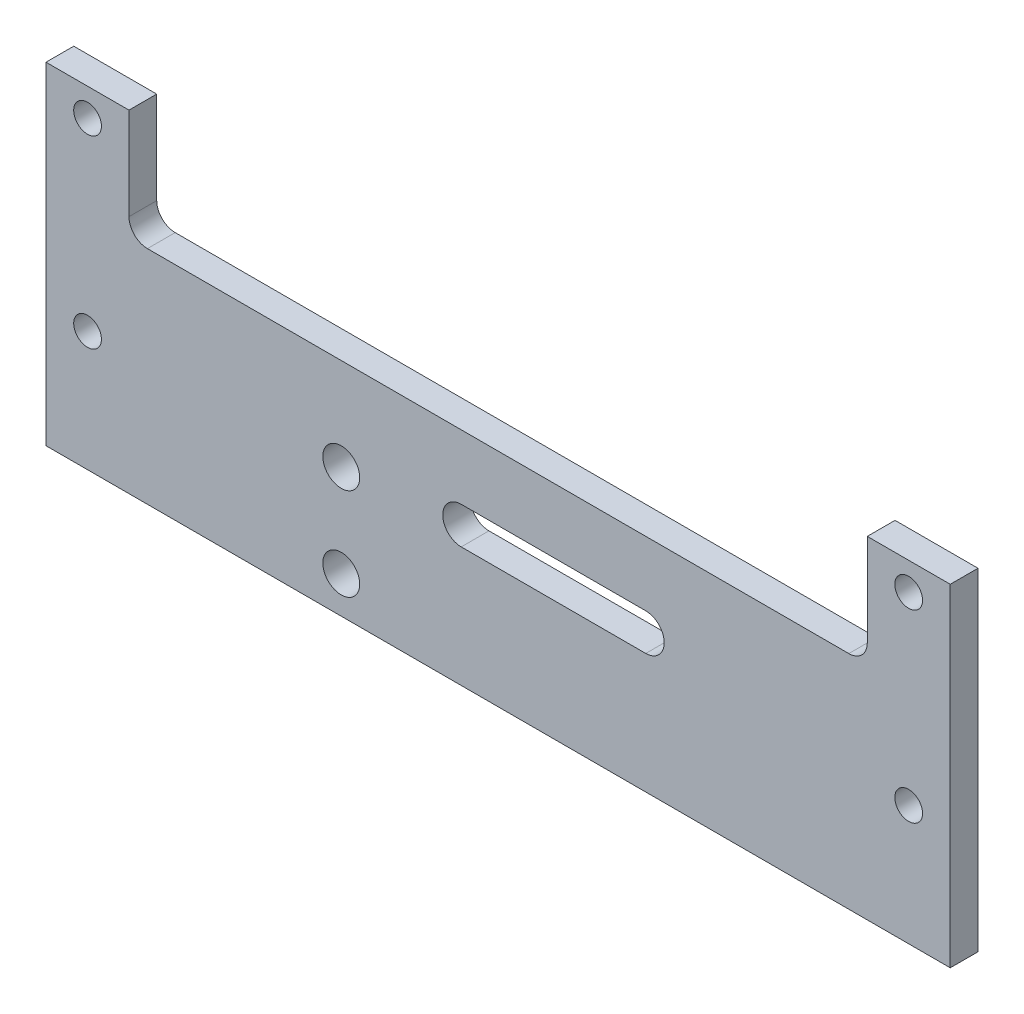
ISO-10303-21;
HEADER;
FILE_DESCRIPTION(('STEP AP214'),'2;1');
FILE_NAME('part.step','',(''),(''),'','','');
FILE_SCHEMA(('AUTOMOTIVE_DESIGN { 1 0 10303 214 1 1 1 1 }'));
ENDSEC;
DATA;
#1=APPLICATION_CONTEXT('core data for automotive mechanical design processes');
#2=APPLICATION_PROTOCOL_DEFINITION('international standard','automotive_design',2000,#1);
#3=PRODUCT_CONTEXT('',#1,'mechanical');
#4=PRODUCT('Part','Part','',(#3));
#5=PRODUCT_RELATED_PRODUCT_CATEGORY('part','',(#4));
#6=PRODUCT_DEFINITION_FORMATION('','',#4);
#7=PRODUCT_DEFINITION_CONTEXT('part definition',#1,'design');
#8=PRODUCT_DEFINITION('design','',#6,#7);
#9=PRODUCT_DEFINITION_SHAPE('','',#8);
#10=(LENGTH_UNIT() NAMED_UNIT(*) SI_UNIT(.MILLI.,.METRE.));
#11=(NAMED_UNIT(*) PLANE_ANGLE_UNIT() SI_UNIT($,.RADIAN.));
#12=(NAMED_UNIT(*) SI_UNIT($,.STERADIAN.) SOLID_ANGLE_UNIT());
#13=UNCERTAINTY_MEASURE_WITH_UNIT(LENGTH_MEASURE(1.E-05),#10,'distance_accuracy_value','');
#14=(GEOMETRIC_REPRESENTATION_CONTEXT(3) GLOBAL_UNCERTAINTY_ASSIGNED_CONTEXT((#13)) GLOBAL_UNIT_ASSIGNED_CONTEXT((#10,
#11,#12)) REPRESENTATION_CONTEXT('',''));
#15=CARTESIAN_POINT('',(0.,0.,0.));
#16=DIRECTION('',(0.,0.,1.));
#17=DIRECTION('',(1.,0.,0.));
#18=AXIS2_PLACEMENT_3D('',#15,#16,#17);
#19=CARTESIAN_POINT('',(0.,0.,4.7752));
#20=DIRECTION('',(0.,0.,1.));
#21=DIRECTION('',(1.,0.,0.));
#22=AXIS2_PLACEMENT_3D('',#19,#20,#21);
#23=PLANE('',#22);
#24=CARTESIAN_POINT('',(-26.9875,6.35,4.7752));
#25=DIRECTION('',(0.,0.,1.));
#26=DIRECTION('',(1.,0.,0.));
#27=AXIS2_PLACEMENT_3D('',#24,#25,#26);
#28=CIRCLE('',#27,3.175);
#29=CARTESIAN_POINT('',(-23.8125,6.35,4.7752));
#30=VERTEX_POINT('',#29);
#31=EDGE_CURVE('E167',#30,#30,#28,.T.);
#32=ORIENTED_EDGE('',*,*,#31,.F.);
#33=EDGE_LOOP('',(#32));
#34=FACE_BOUND('',#33,.T.);
#35=CARTESIAN_POINT('',(70.6374,52.3748,4.7752));
#36=DIRECTION('',(0.,0.,1.));
#37=DIRECTION('',(1.,0.,0.));
#38=AXIS2_PLACEMENT_3D('',#35,#36,#37);
#39=CIRCLE('',#38,2.38760000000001);
#40=CARTESIAN_POINT('',(73.025,52.3748,4.7752));
#41=VERTEX_POINT('',#40);
#42=EDGE_CURVE('E178',#41,#41,#39,.T.);
#43=ORIENTED_EDGE('',*,*,#42,.F.);
#44=EDGE_LOOP('',(#43));
#45=FACE_BOUND('',#44,.T.);
#46=CARTESIAN_POINT('',(-70.6374,52.3748,4.7752));
#47=DIRECTION('',(0.,0.,1.));
#48=DIRECTION('',(1.,0.,0.));
#49=AXIS2_PLACEMENT_3D('',#46,#47,#48);
#50=CIRCLE('',#49,2.38760000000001);
#51=CARTESIAN_POINT('',(-68.2498,52.3748,4.7752));
#52=VERTEX_POINT('',#51);
#53=EDGE_CURVE('E190',#52,#52,#50,.T.);
#54=ORIENTED_EDGE('',*,*,#53,.F.);
#55=EDGE_LOOP('',(#54));
#56=FACE_BOUND('',#55,.T.);
#57=DIRECTION('',(0.,-1.,0.));
#58=VECTOR('',#57,1.);
#59=CARTESIAN_POINT('',(-77.7875,57.15,4.7752));
#60=LINE('',#59,#58);
#61=CARTESIAN_POINT('',(-77.7875,57.15,4.7752));
#62=VERTEX_POINT('',#61);
#63=CARTESIAN_POINT('',(-77.7875,0.,4.7752));
#64=VERTEX_POINT('',#63);
#65=EDGE_CURVE('E202',#62,#64,#60,.T.);
#66=ORIENTED_EDGE('',*,*,#65,.T.);
#67=DIRECTION('',(1.,0.,0.));
#68=VECTOR('',#67,1.);
#69=CARTESIAN_POINT('',(-77.7875,0.,4.7752));
#70=LINE('',#69,#68);
#71=CARTESIAN_POINT('',(77.7875,0.,4.7752));
#72=VERTEX_POINT('',#71);
#73=EDGE_CURVE('E205',#64,#72,#70,.T.);
#74=ORIENTED_EDGE('',*,*,#73,.T.);
#75=DIRECTION('',(0.,1.,0.));
#76=VECTOR('',#75,1.);
#77=CARTESIAN_POINT('',(77.7875,0.,4.7752));
#78=LINE('',#77,#76);
#79=CARTESIAN_POINT('',(77.7875,57.15,4.7752));
#80=VERTEX_POINT('',#79);
#81=EDGE_CURVE('E208',#72,#80,#78,.T.);
#82=ORIENTED_EDGE('',*,*,#81,.T.);
#83=DIRECTION('',(-1.,0.,0.));
#84=VECTOR('',#83,1.);
#85=CARTESIAN_POINT('',(77.7875,57.15,4.7752));
#86=LINE('',#85,#84);
#87=CARTESIAN_POINT('',(63.5127,57.15,4.7752));
#88=VERTEX_POINT('',#87);
#89=EDGE_CURVE('E210',#80,#88,#86,.T.);
#90=ORIENTED_EDGE('',*,*,#89,.T.);
#91=DIRECTION('',(0.,-1.,0.));
#92=VECTOR('',#91,1.);
#93=CARTESIAN_POINT('',(63.5127,57.15,4.7752));
#94=LINE('',#93,#92);
#95=CARTESIAN_POINT('',(63.5127,41.275,4.7752));
#96=VERTEX_POINT('',#95);
#97=EDGE_CURVE('E212',#88,#96,#94,.T.);
#98=ORIENTED_EDGE('',*,*,#97,.T.);
#99=CARTESIAN_POINT('',(60.3377,41.275,4.7752));
#100=DIRECTION('',(0.,0.,1.));
#101=DIRECTION('',(1.,0.,0.));
#102=AXIS2_PLACEMENT_3D('',#99,#100,#101);
#103=CIRCLE('',#102,3.175);
#104=CARTESIAN_POINT('',(60.3377,38.1,4.7752));
#105=VERTEX_POINT('',#104);
#106=EDGE_CURVE('E267',#96,#105,#103,.F.);
#107=ORIENTED_EDGE('',*,*,#106,.T.);
#108=DIRECTION('',(-1.,0.,0.));
#109=VECTOR('',#108,1.);
#110=CARTESIAN_POINT('',(63.5127,38.1,4.7752));
#111=LINE('',#110,#109);
#112=CARTESIAN_POINT('',(-60.3377,38.1,4.7752));
#113=VERTEX_POINT('',#112);
#114=EDGE_CURVE('E215',#105,#113,#111,.T.);
#115=ORIENTED_EDGE('',*,*,#114,.T.);
#116=CARTESIAN_POINT('',(-60.3377,41.275,4.7752));
#117=DIRECTION('',(0.,0.,1.));
#118=DIRECTION('',(1.,0.,0.));
#119=AXIS2_PLACEMENT_3D('',#116,#117,#118);
#120=CIRCLE('',#119,3.175);
#121=CARTESIAN_POINT('',(-63.5127,41.275,4.7752));
#122=VERTEX_POINT('',#121);
#123=EDGE_CURVE('E11',#113,#122,#120,.F.);
#124=ORIENTED_EDGE('',*,*,#123,.T.);
#125=DIRECTION('',(0.,1.,0.));
#126=VECTOR('',#125,1.);
#127=CARTESIAN_POINT('',(-63.5127,38.1,4.7752));
#128=LINE('',#127,#126);
#129=CARTESIAN_POINT('',(-63.5127,57.15,4.7752));
#130=VERTEX_POINT('',#129);
#131=EDGE_CURVE('E217',#122,#130,#128,.T.);
#132=ORIENTED_EDGE('',*,*,#131,.T.);
#133=DIRECTION('',(-1.,0.,0.));
#134=VECTOR('',#133,1.);
#135=CARTESIAN_POINT('',(-63.5127,57.15,4.7752));
#136=LINE('',#135,#134);
#137=EDGE_CURVE('E219',#130,#62,#136,.T.);
#138=ORIENTED_EDGE('',*,*,#137,.T.);
#139=EDGE_LOOP('',(#66,#74,#82,#90,#98,#107,#115,#124,#132,#138));
#140=FACE_BOUND('',#139,.T.);
#141=CARTESIAN_POINT('',(-70.6374,20.6248,4.7752));
#142=DIRECTION('',(0.,0.,1.));
#143=DIRECTION('',(1.,0.,0.));
#144=AXIS2_PLACEMENT_3D('',#141,#142,#143);
#145=CIRCLE('',#144,2.38760000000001);
#146=CARTESIAN_POINT('',(-68.2498,20.6248,4.7752));
#147=VERTEX_POINT('',#146);
#148=EDGE_CURVE('E196',#147,#147,#145,.T.);
#149=ORIENTED_EDGE('',*,*,#148,.F.);
#150=EDGE_LOOP('',(#149));
#151=FACE_BOUND('',#150,.T.);
#152=CARTESIAN_POINT('',(70.6374,20.6248,4.7752));
#153=DIRECTION('',(0.,0.,1.));
#154=DIRECTION('',(1.,0.,0.));
#155=AXIS2_PLACEMENT_3D('',#152,#153,#154);
#156=CIRCLE('',#155,2.38760000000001);
#157=CARTESIAN_POINT('',(73.025,20.6248,4.7752));
#158=VERTEX_POINT('',#157);
#159=EDGE_CURVE('E184',#158,#158,#156,.T.);
#160=ORIENTED_EDGE('',*,*,#159,.F.);
#161=EDGE_LOOP('',(#160));
#162=FACE_BOUND('',#161,.T.);
#163=DIRECTION('',(1.,0.,0.));
#164=VECTOR('',#163,1.);
#165=CARTESIAN_POINT('',(-6.35,20.6502,4.7752));
#166=LINE('',#165,#164);
#167=CARTESIAN_POINT('',(-6.35,20.6502,4.7752));
#168=VERTEX_POINT('',#167);
#169=CARTESIAN_POINT('',(25.4,20.6502,4.7752));
#170=VERTEX_POINT('',#169);
#171=EDGE_CURVE('E144',#168,#170,#166,.T.);
#172=ORIENTED_EDGE('',*,*,#171,.F.);
#173=CARTESIAN_POINT('',(-6.35,23.8252,4.7752));
#174=DIRECTION('',(0.,0.,1.));
#175=DIRECTION('',(1.,0.,0.));
#176=AXIS2_PLACEMENT_3D('',#173,#174,#175);
#177=CIRCLE('',#176,3.175);
#178=CARTESIAN_POINT('',(-6.35,27.0002,4.7752));
#179=VERTEX_POINT('',#178);
#180=EDGE_CURVE('E134',#179,#168,#177,.T.);
#181=ORIENTED_EDGE('',*,*,#180,.F.);
#182=DIRECTION('',(-1.,0.,0.));
#183=VECTOR('',#182,1.);
#184=CARTESIAN_POINT('',(-6.35,27.0002,4.7752));
#185=LINE('',#184,#183);
#186=CARTESIAN_POINT('',(25.4,27.0002,4.7752));
#187=VERTEX_POINT('',#186);
#188=EDGE_CURVE('E160',#187,#179,#185,.T.);
#189=ORIENTED_EDGE('',*,*,#188,.F.);
#190=CARTESIAN_POINT('',(25.4,23.8252,4.7752));
#191=DIRECTION('',(0.,0.,1.));
#192=DIRECTION('',(1.,0.,0.));
#193=AXIS2_PLACEMENT_3D('',#190,#191,#192);
#194=CIRCLE('',#193,3.175);
#195=EDGE_CURVE('E158',#170,#187,#194,.T.);
#196=ORIENTED_EDGE('',*,*,#195,.F.);
#197=EDGE_LOOP('',(#172,#181,#189,#196));
#198=FACE_BOUND('',#197,.T.);
#199=CARTESIAN_POINT('',(-26.9875,22.225,4.7752));
#200=DIRECTION('',(0.,0.,1.));
#201=DIRECTION('',(1.,0.,0.));
#202=AXIS2_PLACEMENT_3D('',#199,#200,#201);
#203=CIRCLE('',#202,3.175);
#204=CARTESIAN_POINT('',(-23.8125,22.225,4.7752));
#205=VERTEX_POINT('',#204);
#206=EDGE_CURVE('E514',#205,#205,#203,.T.);
#207=ORIENTED_EDGE('',*,*,#206,.F.);
#208=EDGE_LOOP('',(#207));
#209=FACE_BOUND('',#208,.T.);
#210=ADVANCED_FACE('F33',(#34,#45,#56,#140,#151,#162,#198,#209),#23,.T.);
#211=CARTESIAN_POINT('',(0.,0.,0.));
#212=DIRECTION('',(0.,0.,1.));
#213=DIRECTION('',(1.,0.,0.));
#214=AXIS2_PLACEMENT_3D('',#211,#212,#213);
#215=PLANE('',#214);
#216=CARTESIAN_POINT('',(-26.9875,6.35,0.));
#217=DIRECTION('',(0.,0.,1.));
#218=DIRECTION('',(1.,0.,0.));
#219=AXIS2_PLACEMENT_3D('',#216,#217,#218);
#220=CIRCLE('',#219,3.175);
#221=CARTESIAN_POINT('',(-23.8125,6.35,0.));
#222=VERTEX_POINT('',#221);
#223=EDGE_CURVE('E513',#222,#222,#220,.T.);
#224=ORIENTED_EDGE('',*,*,#223,.T.);
#225=EDGE_LOOP('',(#224));
#226=FACE_BOUND('',#225,.T.);
#227=CARTESIAN_POINT('',(70.6374,52.3748,0.));
#228=DIRECTION('',(0.,0.,1.));
#229=DIRECTION('',(1.,0.,0.));
#230=AXIS2_PLACEMENT_3D('',#227,#228,#229);
#231=CIRCLE('',#230,2.38760000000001);
#232=CARTESIAN_POINT('',(73.025,52.3748,0.));
#233=VERTEX_POINT('',#232);
#234=EDGE_CURVE('E152',#233,#233,#231,.T.);
#235=ORIENTED_EDGE('',*,*,#234,.T.);
#236=EDGE_LOOP('',(#235));
#237=FACE_BOUND('',#236,.T.);
#238=CARTESIAN_POINT('',(-70.6374,52.3748,0.));
#239=DIRECTION('',(0.,0.,1.));
#240=DIRECTION('',(1.,0.,0.));
#241=AXIS2_PLACEMENT_3D('',#238,#239,#240);
#242=CIRCLE('',#241,2.38760000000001);
#243=CARTESIAN_POINT('',(-68.2498,52.3748,0.));
#244=VERTEX_POINT('',#243);
#245=EDGE_CURVE('E187',#244,#244,#242,.T.);
#246=ORIENTED_EDGE('',*,*,#245,.T.);
#247=EDGE_LOOP('',(#246));
#248=FACE_BOUND('',#247,.T.);
#249=DIRECTION('',(0.,-1.,0.));
#250=VECTOR('',#249,1.);
#251=CARTESIAN_POINT('',(-77.7875,57.15,0.));
#252=LINE('',#251,#250);
#253=CARTESIAN_POINT('',(-77.7875,57.15,0.));
#254=VERTEX_POINT('',#253);
#255=CARTESIAN_POINT('',(-77.7875,0.,0.));
#256=VERTEX_POINT('',#255);
#257=EDGE_CURVE('E199',#254,#256,#252,.T.);
#258=ORIENTED_EDGE('',*,*,#257,.F.);
#259=DIRECTION('',(-1.,0.,0.));
#260=VECTOR('',#259,1.);
#261=CARTESIAN_POINT('',(-63.5127,57.15,0.));
#262=LINE('',#261,#260);
#263=CARTESIAN_POINT('',(-63.5127,57.15,0.));
#264=VERTEX_POINT('',#263);
#265=EDGE_CURVE('E206',#264,#254,#262,.T.);
#266=ORIENTED_EDGE('',*,*,#265,.F.);
#267=DIRECTION('',(0.,1.,0.));
#268=VECTOR('',#267,1.);
#269=CARTESIAN_POINT('',(-63.5127,38.1,0.));
#270=LINE('',#269,#268);
#271=CARTESIAN_POINT('',(-63.5127,41.275,0.));
#272=VERTEX_POINT('',#271);
#273=EDGE_CURVE('E236',#272,#264,#270,.T.);
#274=ORIENTED_EDGE('',*,*,#273,.F.);
#275=CARTESIAN_POINT('',(-60.3377,41.275,0.));
#276=DIRECTION('',(0.,0.,1.));
#277=DIRECTION('',(1.,0.,0.));
#278=AXIS2_PLACEMENT_3D('',#275,#276,#277);
#279=CIRCLE('',#278,3.175);
#280=CARTESIAN_POINT('',(-60.3377,38.1,0.));
#281=VERTEX_POINT('',#280);
#282=EDGE_CURVE('E41',#272,#281,#279,.T.);
#283=ORIENTED_EDGE('',*,*,#282,.T.);
#284=DIRECTION('',(-1.,0.,0.));
#285=VECTOR('',#284,1.);
#286=CARTESIAN_POINT('',(63.5127,38.1,0.));
#287=LINE('',#286,#285);
#288=CARTESIAN_POINT('',(60.3377,38.1,0.));
#289=VERTEX_POINT('',#288);
#290=EDGE_CURVE('E233',#289,#281,#287,.T.);
#291=ORIENTED_EDGE('',*,*,#290,.F.);
#292=CARTESIAN_POINT('',(60.3377,41.275,0.));
#293=DIRECTION('',(0.,0.,1.));
#294=DIRECTION('',(1.,0.,0.));
#295=AXIS2_PLACEMENT_3D('',#292,#293,#294);
#296=CIRCLE('',#295,3.175);
#297=CARTESIAN_POINT('',(63.5127,41.275,0.));
#298=VERTEX_POINT('',#297);
#299=EDGE_CURVE('E265',#289,#298,#296,.T.);
#300=ORIENTED_EDGE('',*,*,#299,.T.);
#301=DIRECTION('',(0.,-1.,0.));
#302=VECTOR('',#301,1.);
#303=CARTESIAN_POINT('',(63.5127,57.15,0.));
#304=LINE('',#303,#302);
#305=CARTESIAN_POINT('',(63.5127,57.15,0.));
#306=VERTEX_POINT('',#305);
#307=EDGE_CURVE('E230',#306,#298,#304,.T.);
#308=ORIENTED_EDGE('',*,*,#307,.F.);
#309=DIRECTION('',(-1.,0.,0.));
#310=VECTOR('',#309,1.);
#311=CARTESIAN_POINT('',(77.7875,57.15,0.));
#312=LINE('',#311,#310);
#313=CARTESIAN_POINT('',(77.7875,57.15,0.));
#314=VERTEX_POINT('',#313);
#315=EDGE_CURVE('E228',#314,#306,#312,.T.);
#316=ORIENTED_EDGE('',*,*,#315,.F.);
#317=DIRECTION('',(0.,1.,0.));
#318=VECTOR('',#317,1.);
#319=CARTESIAN_POINT('',(77.7875,0.,0.));
#320=LINE('',#319,#318);
#321=CARTESIAN_POINT('',(77.7875,0.,0.));
#322=VERTEX_POINT('',#321);
#323=EDGE_CURVE('E226',#322,#314,#320,.T.);
#324=ORIENTED_EDGE('',*,*,#323,.F.);
#325=DIRECTION('',(1.,0.,0.));
#326=VECTOR('',#325,1.);
#327=CARTESIAN_POINT('',(0.,0.,0.));
#328=LINE('',#327,#326);
#329=EDGE_CURVE('E224',#256,#322,#328,.T.);
#330=ORIENTED_EDGE('',*,*,#329,.F.);
#331=EDGE_LOOP('',(#258,#266,#274,#283,#291,#300,#308,#316,#324,#330));
#332=FACE_BOUND('',#331,.T.);
#333=CARTESIAN_POINT('',(-70.6374,20.6248,0.));
#334=DIRECTION('',(0.,0.,1.));
#335=DIRECTION('',(1.,0.,0.));
#336=AXIS2_PLACEMENT_3D('',#333,#334,#335);
#337=CIRCLE('',#336,2.38760000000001);
#338=CARTESIAN_POINT('',(-68.2498,20.6248,0.));
#339=VERTEX_POINT('',#338);
#340=EDGE_CURVE('E193',#339,#339,#337,.T.);
#341=ORIENTED_EDGE('',*,*,#340,.T.);
#342=EDGE_LOOP('',(#341));
#343=FACE_BOUND('',#342,.T.);
#344=CARTESIAN_POINT('',(70.6374,20.6248,0.));
#345=DIRECTION('',(0.,0.,1.));
#346=DIRECTION('',(1.,0.,0.));
#347=AXIS2_PLACEMENT_3D('',#344,#345,#346);
#348=CIRCLE('',#347,2.38760000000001);
#349=CARTESIAN_POINT('',(73.025,20.6248,0.));
#350=VERTEX_POINT('',#349);
#351=EDGE_CURVE('E181',#350,#350,#348,.T.);
#352=ORIENTED_EDGE('',*,*,#351,.T.);
#353=EDGE_LOOP('',(#352));
#354=FACE_BOUND('',#353,.T.);
#355=CARTESIAN_POINT('',(-6.35,23.8252,0.));
#356=DIRECTION('',(0.,0.,1.));
#357=DIRECTION('',(1.,0.,0.));
#358=AXIS2_PLACEMENT_3D('',#355,#356,#357);
#359=CIRCLE('',#358,3.175);
#360=CARTESIAN_POINT('',(-6.35,27.0002,0.));
#361=VERTEX_POINT('',#360);
#362=CARTESIAN_POINT('',(-6.35,20.6502,0.));
#363=VERTEX_POINT('',#362);
#364=EDGE_CURVE('E165',#361,#363,#359,.T.);
#365=ORIENTED_EDGE('',*,*,#364,.T.);
#366=DIRECTION('',(1.,0.,0.));
#367=VECTOR('',#366,1.);
#368=CARTESIAN_POINT('',(-6.35,20.6502,0.));
#369=LINE('',#368,#367);
#370=CARTESIAN_POINT('',(25.4,20.6502,0.));
#371=VERTEX_POINT('',#370);
#372=EDGE_CURVE('E151',#363,#371,#369,.T.);
#373=ORIENTED_EDGE('',*,*,#372,.T.);
#374=CARTESIAN_POINT('',(25.4,23.8252,0.));
#375=DIRECTION('',(0.,0.,1.));
#376=DIRECTION('',(1.,0.,0.));
#377=AXIS2_PLACEMENT_3D('',#374,#375,#376);
#378=CIRCLE('',#377,3.175);
#379=CARTESIAN_POINT('',(25.4,27.0002,0.));
#380=VERTEX_POINT('',#379);
#381=EDGE_CURVE('E169',#371,#380,#378,.T.);
#382=ORIENTED_EDGE('',*,*,#381,.T.);
#383=DIRECTION('',(-1.,0.,0.));
#384=VECTOR('',#383,1.);
#385=CARTESIAN_POINT('',(-6.35,27.0002,0.));
#386=LINE('',#385,#384);
#387=EDGE_CURVE('E145',#380,#361,#386,.T.);
#388=ORIENTED_EDGE('',*,*,#387,.T.);
#389=EDGE_LOOP('',(#365,#373,#382,#388));
#390=FACE_BOUND('',#389,.T.);
#391=CARTESIAN_POINT('',(-26.9875,22.225,0.));
#392=DIRECTION('',(0.,0.,1.));
#393=DIRECTION('',(1.,0.,0.));
#394=AXIS2_PLACEMENT_3D('',#391,#392,#393);
#395=CIRCLE('',#394,3.175);
#396=CARTESIAN_POINT('',(-23.8125,22.225,0.));
#397=VERTEX_POINT('',#396);
#398=EDGE_CURVE('E517',#397,#397,#395,.T.);
#399=ORIENTED_EDGE('',*,*,#398,.T.);
#400=EDGE_LOOP('',(#399));
#401=FACE_BOUND('',#400,.T.);
#402=ADVANCED_FACE('F272',(#226,#237,#248,#332,#343,#354,#390,#401),#215,.F.);
#403=CARTESIAN_POINT('',(-77.7875,57.15,4.7752));
#404=DIRECTION('',(1.,0.,0.));
#405=DIRECTION('',(0.,0.,-1.));
#406=AXIS2_PLACEMENT_3D('',#403,#404,#405);
#407=PLANE('',#406);
#408=ORIENTED_EDGE('',*,*,#257,.T.);
#409=DIRECTION('',(0.,0.,-1.));
#410=VECTOR('',#409,1.);
#411=CARTESIAN_POINT('',(-77.7875,0.,4.7752));
#412=LINE('',#411,#410);
#413=EDGE_CURVE('E253',#64,#256,#412,.T.);
#414=ORIENTED_EDGE('',*,*,#413,.F.);
#415=ORIENTED_EDGE('',*,*,#65,.F.);
#416=DIRECTION('',(0.,0.,-1.));
#417=VECTOR('',#416,1.);
#418=CARTESIAN_POINT('',(-77.7875,57.15,4.7752));
#419=LINE('',#418,#417);
#420=EDGE_CURVE('E221',#62,#254,#419,.T.);
#421=ORIENTED_EDGE('',*,*,#420,.T.);
#422=EDGE_LOOP('',(#408,#414,#415,#421));
#423=FACE_BOUND('',#422,.T.);
#424=ADVANCED_FACE('F290',(#423),#407,.F.);
#425=CARTESIAN_POINT('',(0.,0.,4.7752));
#426=DIRECTION('',(0.,1.,0.));
#427=DIRECTION('',(-1.,0.,0.));
#428=AXIS2_PLACEMENT_3D('',#425,#426,#427);
#429=PLANE('',#428);
#430=ORIENTED_EDGE('',*,*,#329,.T.);
#431=DIRECTION('',(0.,0.,-1.));
#432=VECTOR('',#431,1.);
#433=CARTESIAN_POINT('',(77.7875,0.,4.7752));
#434=LINE('',#433,#432);
#435=EDGE_CURVE('E250',#72,#322,#434,.T.);
#436=ORIENTED_EDGE('',*,*,#435,.F.);
#437=ORIENTED_EDGE('',*,*,#73,.F.);
#438=ORIENTED_EDGE('',*,*,#413,.T.);
#439=EDGE_LOOP('',(#430,#436,#437,#438));
#440=FACE_BOUND('',#439,.T.);
#441=ADVANCED_FACE('F292',(#440),#429,.F.);
#442=CARTESIAN_POINT('',(77.7875,0.,4.7752));
#443=DIRECTION('',(-1.,0.,0.));
#444=DIRECTION('',(0.,0.,1.));
#445=AXIS2_PLACEMENT_3D('',#442,#443,#444);
#446=PLANE('',#445);
#447=ORIENTED_EDGE('',*,*,#323,.T.);
#448=DIRECTION('',(0.,0.,-1.));
#449=VECTOR('',#448,1.);
#450=CARTESIAN_POINT('',(77.7875,57.15,4.7752));
#451=LINE('',#450,#449);
#452=EDGE_CURVE('E247',#80,#314,#451,.T.);
#453=ORIENTED_EDGE('',*,*,#452,.F.);
#454=ORIENTED_EDGE('',*,*,#81,.F.);
#455=ORIENTED_EDGE('',*,*,#435,.T.);
#456=EDGE_LOOP('',(#447,#453,#454,#455));
#457=FACE_BOUND('',#456,.T.);
#458=ADVANCED_FACE('F299',(#457),#446,.F.);
#459=CARTESIAN_POINT('',(77.7875,57.15,4.7752));
#460=DIRECTION('',(0.,-1.,0.));
#461=DIRECTION('',(0.,0.,-1.));
#462=AXIS2_PLACEMENT_3D('',#459,#460,#461);
#463=PLANE('',#462);
#464=ORIENTED_EDGE('',*,*,#315,.T.);
#465=DIRECTION('',(0.,0.,-1.));
#466=VECTOR('',#465,1.);
#467=CARTESIAN_POINT('',(63.5127,57.15,4.7752));
#468=LINE('',#467,#466);
#469=EDGE_CURVE('E244',#88,#306,#468,.T.);
#470=ORIENTED_EDGE('',*,*,#469,.F.);
#471=ORIENTED_EDGE('',*,*,#89,.F.);
#472=ORIENTED_EDGE('',*,*,#452,.T.);
#473=EDGE_LOOP('',(#464,#470,#471,#472));
#474=FACE_BOUND('',#473,.T.);
#475=ADVANCED_FACE('F303',(#474),#463,.F.);
#476=CARTESIAN_POINT('',(63.5127,57.15,4.7752));
#477=DIRECTION('',(1.,0.,0.));
#478=DIRECTION('',(0.,0.,-1.));
#479=AXIS2_PLACEMENT_3D('',#476,#477,#478);
#480=PLANE('',#479);
#481=ORIENTED_EDGE('',*,*,#307,.T.);
#482=DIRECTION('',(0.,0.,-1.));
#483=VECTOR('',#482,1.);
#484=CARTESIAN_POINT('',(63.5127,41.275,4.7752));
#485=LINE('',#484,#483);
#486=EDGE_CURVE('E261',#298,#96,#485,.F.);
#487=ORIENTED_EDGE('',*,*,#486,.T.);
#488=ORIENTED_EDGE('',*,*,#97,.F.);
#489=ORIENTED_EDGE('',*,*,#469,.T.);
#490=EDGE_LOOP('',(#481,#487,#488,#489));
#491=FACE_BOUND('',#490,.T.);
#492=ADVANCED_FACE('F307',(#491),#480,.F.);
#493=CARTESIAN_POINT('',(63.5127,38.1,4.7752));
#494=DIRECTION('',(0.,-1.,0.));
#495=DIRECTION('',(0.,0.,-1.));
#496=AXIS2_PLACEMENT_3D('',#493,#494,#495);
#497=PLANE('',#496);
#498=ORIENTED_EDGE('',*,*,#114,.F.);
#499=DIRECTION('',(0.,0.,-1.));
#500=VECTOR('',#499,1.);
#501=CARTESIAN_POINT('',(60.3377,38.1,0.));
#502=LINE('',#501,#500);
#503=EDGE_CURVE('E258',#105,#289,#502,.T.);
#504=ORIENTED_EDGE('',*,*,#503,.T.);
#505=ORIENTED_EDGE('',*,*,#290,.T.);
#506=DIRECTION('',(0.,0.,-1.));
#507=VECTOR('',#506,1.);
#508=CARTESIAN_POINT('',(-60.3377,38.1,4.7752));
#509=LINE('',#508,#507);
#510=EDGE_CURVE('E256',#281,#113,#509,.F.);
#511=ORIENTED_EDGE('',*,*,#510,.T.);
#512=EDGE_LOOP('',(#498,#504,#505,#511));
#513=FACE_BOUND('',#512,.T.);
#514=ADVANCED_FACE('F277',(#513),#497,.F.);
#515=CARTESIAN_POINT('',(-63.5127,38.1,4.7752));
#516=DIRECTION('',(-1.,0.,0.));
#517=DIRECTION('',(0.,0.,1.));
#518=AXIS2_PLACEMENT_3D('',#515,#516,#517);
#519=PLANE('',#518);
#520=ORIENTED_EDGE('',*,*,#131,.F.);
#521=DIRECTION('',(0.,0.,-1.));
#522=VECTOR('',#521,1.);
#523=CARTESIAN_POINT('',(-63.5127,41.275,0.));
#524=LINE('',#523,#522);
#525=EDGE_CURVE('E263',#122,#272,#524,.T.);
#526=ORIENTED_EDGE('',*,*,#525,.T.);
#527=ORIENTED_EDGE('',*,*,#273,.T.);
#528=DIRECTION('',(0.,0.,-1.));
#529=VECTOR('',#528,1.);
#530=CARTESIAN_POINT('',(-63.5127,57.15,4.7752));
#531=LINE('',#530,#529);
#532=EDGE_CURVE('E241',#130,#264,#531,.T.);
#533=ORIENTED_EDGE('',*,*,#532,.F.);
#534=EDGE_LOOP('',(#520,#526,#527,#533));
#535=FACE_BOUND('',#534,.T.);
#536=ADVANCED_FACE('F280',(#535),#519,.F.);
#537=CARTESIAN_POINT('',(-63.5127,57.15,4.7752));
#538=DIRECTION('',(0.,-1.,0.));
#539=DIRECTION('',(0.,0.,-1.));
#540=AXIS2_PLACEMENT_3D('',#537,#538,#539);
#541=PLANE('',#540);
#542=ORIENTED_EDGE('',*,*,#265,.T.);
#543=ORIENTED_EDGE('',*,*,#420,.F.);
#544=ORIENTED_EDGE('',*,*,#137,.F.);
#545=ORIENTED_EDGE('',*,*,#532,.T.);
#546=EDGE_LOOP('',(#542,#543,#544,#545));
#547=FACE_BOUND('',#546,.T.);
#548=ADVANCED_FACE('F288',(#547),#541,.F.);
#549=CARTESIAN_POINT('',(-70.6374,20.6248,4.7752));
#550=DIRECTION('',(0.,0.,-1.));
#551=DIRECTION('',(-1.,0.,0.));
#552=AXIS2_PLACEMENT_3D('',#549,#550,#551);
#553=CYLINDRICAL_SURFACE('',#552,2.38760000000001);
#554=ORIENTED_EDGE('',*,*,#148,.T.);
#555=EDGE_LOOP('',(#554));
#556=FACE_BOUND('',#555,.T.);
#557=ORIENTED_EDGE('',*,*,#340,.F.);
#558=EDGE_LOOP('',(#557));
#559=FACE_BOUND('',#558,.T.);
#560=ADVANCED_FACE('F333',(#556,#559),#553,.F.);
#561=CARTESIAN_POINT('',(-70.6374,52.3748,4.7752));
#562=DIRECTION('',(0.,0.,-1.));
#563=DIRECTION('',(-1.,0.,0.));
#564=AXIS2_PLACEMENT_3D('',#561,#562,#563);
#565=CYLINDRICAL_SURFACE('',#564,2.38760000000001);
#566=ORIENTED_EDGE('',*,*,#53,.T.);
#567=EDGE_LOOP('',(#566));
#568=FACE_BOUND('',#567,.T.);
#569=ORIENTED_EDGE('',*,*,#245,.F.);
#570=EDGE_LOOP('',(#569));
#571=FACE_BOUND('',#570,.T.);
#572=ADVANCED_FACE('F388',(#568,#571),#565,.F.);
#573=CARTESIAN_POINT('',(70.6374,20.6248,4.7752));
#574=DIRECTION('',(0.,0.,-1.));
#575=DIRECTION('',(-1.,0.,0.));
#576=AXIS2_PLACEMENT_3D('',#573,#574,#575);
#577=CYLINDRICAL_SURFACE('',#576,2.38760000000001);
#578=ORIENTED_EDGE('',*,*,#159,.T.);
#579=EDGE_LOOP('',(#578));
#580=FACE_BOUND('',#579,.T.);
#581=ORIENTED_EDGE('',*,*,#351,.F.);
#582=EDGE_LOOP('',(#581));
#583=FACE_BOUND('',#582,.T.);
#584=ADVANCED_FACE('F395',(#580,#583),#577,.F.);
#585=CARTESIAN_POINT('',(70.6374,52.3748,4.7752));
#586=DIRECTION('',(0.,0.,-1.));
#587=DIRECTION('',(-1.,0.,0.));
#588=AXIS2_PLACEMENT_3D('',#585,#586,#587);
#589=CYLINDRICAL_SURFACE('',#588,2.38760000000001);
#590=ORIENTED_EDGE('',*,*,#42,.T.);
#591=EDGE_LOOP('',(#590));
#592=FACE_BOUND('',#591,.T.);
#593=ORIENTED_EDGE('',*,*,#234,.F.);
#594=EDGE_LOOP('',(#593));
#595=FACE_BOUND('',#594,.T.);
#596=ADVANCED_FACE('F402',(#592,#595),#589,.F.);
#597=CARTESIAN_POINT('',(-6.35,23.8252,4.7752));
#598=DIRECTION('',(0.,0.,-1.));
#599=DIRECTION('',(-1.,0.,0.));
#600=AXIS2_PLACEMENT_3D('',#597,#598,#599);
#601=CYLINDRICAL_SURFACE('',#600,3.175);
#602=ORIENTED_EDGE('',*,*,#364,.F.);
#603=DIRECTION('',(0.,0.,-1.));
#604=VECTOR('',#603,1.);
#605=CARTESIAN_POINT('',(-6.35,27.0002,4.7752));
#606=LINE('',#605,#604);
#607=EDGE_CURVE('E140',#179,#361,#606,.T.);
#608=ORIENTED_EDGE('',*,*,#607,.F.);
#609=ORIENTED_EDGE('',*,*,#180,.T.);
#610=DIRECTION('',(0.,0.,-1.));
#611=VECTOR('',#610,1.);
#612=CARTESIAN_POINT('',(-6.35,20.6502,4.7752));
#613=LINE('',#612,#611);
#614=EDGE_CURVE('E137',#168,#363,#613,.T.);
#615=ORIENTED_EDGE('',*,*,#614,.T.);
#616=EDGE_LOOP('',(#602,#608,#609,#615));
#617=FACE_BOUND('',#616,.T.);
#618=ADVANCED_FACE('F136',(#617),#601,.F.);
#619=CARTESIAN_POINT('',(-6.35,20.6502,4.7752));
#620=DIRECTION('',(0.,1.,0.));
#621=DIRECTION('',(0.,0.,1.));
#622=AXIS2_PLACEMENT_3D('',#619,#620,#621);
#623=PLANE('',#622);
#624=ORIENTED_EDGE('',*,*,#372,.F.);
#625=ORIENTED_EDGE('',*,*,#614,.F.);
#626=ORIENTED_EDGE('',*,*,#171,.T.);
#627=DIRECTION('',(0.,0.,-1.));
#628=VECTOR('',#627,1.);
#629=CARTESIAN_POINT('',(25.4,20.6502,4.7752));
#630=LINE('',#629,#628);
#631=EDGE_CURVE('E153',#170,#371,#630,.T.);
#632=ORIENTED_EDGE('',*,*,#631,.T.);
#633=EDGE_LOOP('',(#624,#625,#626,#632));
#634=FACE_BOUND('',#633,.T.);
#635=ADVANCED_FACE('F148',(#634),#623,.T.);
#636=CARTESIAN_POINT('',(25.4,23.8252,4.7752));
#637=DIRECTION('',(0.,0.,-1.));
#638=DIRECTION('',(-1.,0.,0.));
#639=AXIS2_PLACEMENT_3D('',#636,#637,#638);
#640=CYLINDRICAL_SURFACE('',#639,3.175);
#641=ORIENTED_EDGE('',*,*,#381,.F.);
#642=ORIENTED_EDGE('',*,*,#631,.F.);
#643=ORIENTED_EDGE('',*,*,#195,.T.);
#644=DIRECTION('',(0.,0.,-1.));
#645=VECTOR('',#644,1.);
#646=CARTESIAN_POINT('',(25.4,27.0002,4.7752));
#647=LINE('',#646,#645);
#648=EDGE_CURVE('E175',#187,#380,#647,.T.);
#649=ORIENTED_EDGE('',*,*,#648,.T.);
#650=EDGE_LOOP('',(#641,#642,#643,#649));
#651=FACE_BOUND('',#650,.T.);
#652=ADVANCED_FACE('F423',(#651),#640,.F.);
#653=CARTESIAN_POINT('',(-6.35,27.0002,4.7752));
#654=DIRECTION('',(0.,-1.,0.));
#655=DIRECTION('',(0.,0.,-1.));
#656=AXIS2_PLACEMENT_3D('',#653,#654,#655);
#657=PLANE('',#656);
#658=ORIENTED_EDGE('',*,*,#387,.F.);
#659=ORIENTED_EDGE('',*,*,#648,.F.);
#660=ORIENTED_EDGE('',*,*,#188,.T.);
#661=ORIENTED_EDGE('',*,*,#607,.T.);
#662=EDGE_LOOP('',(#658,#659,#660,#661));
#663=FACE_BOUND('',#662,.T.);
#664=ADVANCED_FACE('F430',(#663),#657,.T.);
#665=CARTESIAN_POINT('',(-26.9875,6.35,4.7752));
#666=DIRECTION('',(0.,0.,-1.));
#667=DIRECTION('',(-1.,0.,0.));
#668=AXIS2_PLACEMENT_3D('',#665,#666,#667);
#669=CYLINDRICAL_SURFACE('',#668,3.175);
#670=ORIENTED_EDGE('',*,*,#31,.T.);
#671=EDGE_LOOP('',(#670));
#672=FACE_BOUND('',#671,.T.);
#673=ORIENTED_EDGE('',*,*,#223,.F.);
#674=EDGE_LOOP('',(#673));
#675=FACE_BOUND('',#674,.T.);
#676=ADVANCED_FACE('F318',(#672,#675),#669,.F.);
#677=CARTESIAN_POINT('',(-26.9875,22.225,4.7752));
#678=DIRECTION('',(0.,0.,-1.));
#679=DIRECTION('',(-1.,0.,0.));
#680=AXIS2_PLACEMENT_3D('',#677,#678,#679);
#681=CYLINDRICAL_SURFACE('',#680,3.175);
#682=ORIENTED_EDGE('',*,*,#206,.T.);
#683=EDGE_LOOP('',(#682));
#684=FACE_BOUND('',#683,.T.);
#685=ORIENTED_EDGE('',*,*,#398,.F.);
#686=EDGE_LOOP('',(#685));
#687=FACE_BOUND('',#686,.T.);
#688=ADVANCED_FACE('F313',(#684,#687),#681,.F.);
#689=CARTESIAN_POINT('',(60.3377,41.275,4.7752));
#690=DIRECTION('',(0.,0.,1.));
#691=DIRECTION('',(1.,0.,0.));
#692=AXIS2_PLACEMENT_3D('',#689,#690,#691);
#693=CYLINDRICAL_SURFACE('',#692,3.175);
#694=ORIENTED_EDGE('',*,*,#106,.F.);
#695=ORIENTED_EDGE('',*,*,#486,.F.);
#696=ORIENTED_EDGE('',*,*,#299,.F.);
#697=ORIENTED_EDGE('',*,*,#503,.F.);
#698=EDGE_LOOP('',(#694,#695,#696,#697));
#699=FACE_BOUND('',#698,.T.);
#700=ADVANCED_FACE('F311',(#699),#693,.F.);
#701=CARTESIAN_POINT('',(-60.3377,41.275,4.7752));
#702=DIRECTION('',(0.,0.,1.));
#703=DIRECTION('',(1.,0.,0.));
#704=AXIS2_PLACEMENT_3D('',#701,#702,#703);
#705=CYLINDRICAL_SURFACE('',#704,3.175);
#706=ORIENTED_EDGE('',*,*,#123,.F.);
#707=ORIENTED_EDGE('',*,*,#510,.F.);
#708=ORIENTED_EDGE('',*,*,#282,.F.);
#709=ORIENTED_EDGE('',*,*,#525,.F.);
#710=EDGE_LOOP('',(#706,#707,#708,#709));
#711=FACE_BOUND('',#710,.T.);
#712=ADVANCED_FACE('F35',(#711),#705,.F.);
#713=CLOSED_SHELL('',(#210,#402,#424,#441,#458,#475,#492,#514,#536,#548,#560,#572,#584,#596,
#618,#635,#652,#664,#676,#688,#700,#712));
#714=MANIFOLD_SOLID_BREP('B2',#713);
#715=ADVANCED_BREP_SHAPE_REPRESENTATION('',(#18,#714),#14);
#716=SHAPE_DEFINITION_REPRESENTATION(#9,#715);
ENDSEC;
END-ISO-10303-21;
